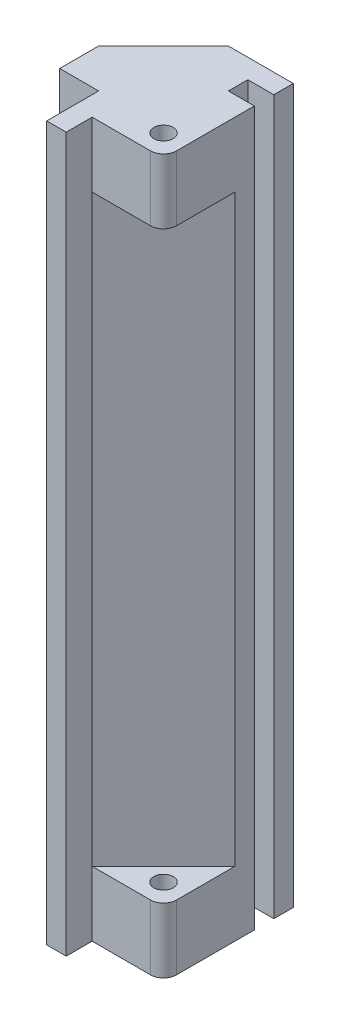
from build123d import *

# Parameters (mm, degrees)
BOSS_EXTRUDE1_DEPTH = 110
SKETCH2_W           = 4
SKETCH2_H           = 110
CUT_EXTRUDE1_DEPTH  = 10
SKETCH3_W           = 3
SKETCH3_H           = 110
BOSS_EXTRUDE2_DEPTH = 4
SKETCH4_R           = 1.5
BOSS_EXTRUDE3_DEPTH = 10
BOSS_EXTRUDE4_START = -10
SKETCH5_R           = 1.5
BOSS_EXTRUDE4_DEPTH = 10
FILLET1_R           = 2


with BuildPart() as part:
    # Sketch1 → Boss-Extrude1 (new body)
    with BuildSketch(Plane(origin=(0, 0, 0), x_dir=(1, 0, 0), z_dir=(0, 1, 0))):
        Polygon((-5, 10), (5, 20), (15, 20), (15, 17), (11, 17), (11, 14), (15, 14), (15, 11), (4, 0), (1, 0), (1, 4), (-2, 4), (-2, 0), (-5, 0), align=None)
    extrude(amount=BOSS_EXTRUDE1_DEPTH)

    # Sketch2 → Cut-Extrude1 (cut)
    with BuildSketch(Plane(origin=(-2, 0, 0), x_dir=(0, 0, -1), z_dir=(1, 0, 0))):
        with Locations((2, 55)):
            Rectangle(SKETCH2_W, SKETCH2_H)
    extrude(amount=-CUT_EXTRUDE1_DEPTH, mode=Mode.SUBTRACT)

    # Sketch3 → Boss-Extrude2 (add)
    with BuildSketch(Plane.XY):
        with Locations((2.5, 55)):
            Rectangle(SKETCH3_W, SKETCH3_H)
    extrude(amount=BOSS_EXTRUDE2_DEPTH)

    # Sketch4 → Boss-Extrude3 (add)
    with BuildSketch(Plane.XZ):
        Polygon((4, 0), (15, 0), (15, -11), align=None)
        with Locations(Location((11.621320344, -3.378679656, 0), (0, 0, 270))):
            Circle(SKETCH4_R, mode=Mode.SUBTRACT)
    extrude(amount=-BOSS_EXTRUDE3_DEPTH)

    # Sketch5 → Boss-Extrude4 (add)
    with BuildSketch(Plane(origin=(0, 110, 0), x_dir=(1, 0, 0), z_dir=(0, 1, 0)).offset(BOSS_EXTRUDE4_START)):
        Polygon((15, 11), (15, 0), (4, 0), align=None)
        with Locations(Location((11.621320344, 3.378679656, 0), (0, 0, 90))):
            Circle(SKETCH5_R, mode=Mode.SUBTRACT)
    extrude(amount=BOSS_EXTRUDE4_DEPTH)

    # Fillet1
    fillet1_edges = [part.edges().sort_by_distance(p)[0] for p in [
        (15, 5, 0),
        (15, 105, 0),
    ]]
    fillet(fillet1_edges, radius=FILLET1_R)


solid = part.part
